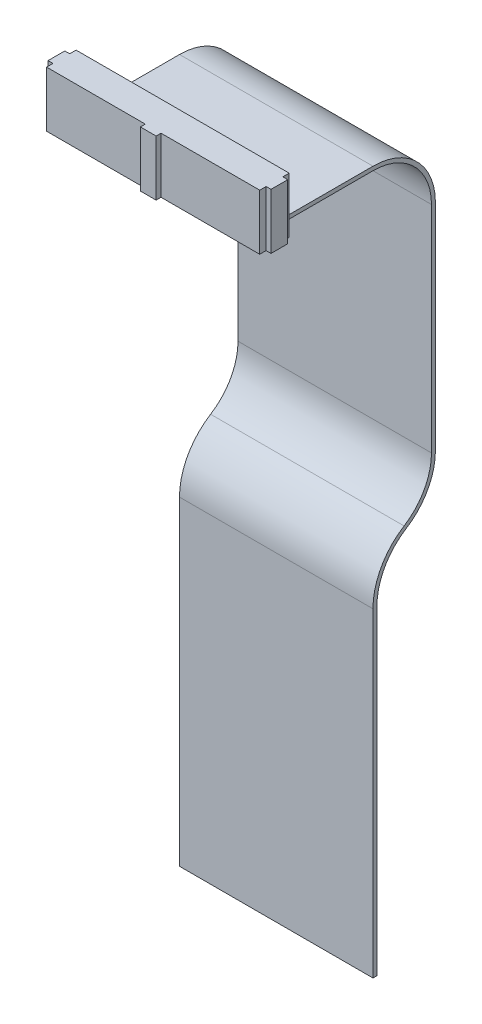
from build123d import *

# Parameters (mm, degrees)
EXTRUDE1_DEPTH = 11.3
SKETCH2_W      = 3
SKETCH2_H      = 0.8
EXTRUDE2_DEPTH = 19.685
SKETCH5_W      = 39.37
SKETCH5_H      = 0.8


with BuildPart() as part:
    # Sketch1 → Extrude1 (new body)
    with BuildSketch(Plane(origin=(0, 0, 0), x_dir=(1, 0, 0), z_dir=(0, 1, 0))):
        Polygon((-21.685, 6), (21.685, 6), (21.685, 4.7), (22.685, 4.7), (22.685, 1.3), (21.685, 1.3), (21.685, 0), (1.6, 0), (1.6, -1), (-1.6, -1), (-1.6, 0), (-21.685, 0), (-21.685, 1.3), (-22.685, 1.3), (-22.685, 4.7), (-21.685, 4.7), align=None)
    extrude(amount=EXTRUDE1_DEPTH)

    # Sketch2 → Extrude2 (add, symmetric)
    with BuildSketch(Plane(origin=(0, 0, 0), x_dir=(0, 0, -1), z_dir=(1, 0, 0))):
        with Locations((7.5, 1.6)):
            Rectangle(SKETCH2_W, SKETCH2_H)
    extrude(amount=EXTRUDE2_DEPTH, both=True)

    # Sweep2: sweep along a path in Sketch6
    with BuildLine(Plane(origin=(0, 0, 0), x_dir=(0, 0, -1), z_dir=(1, 0, 0))) as sweep2_path:
        Line((9, 2), (25.05, 2))
        ThreePointArc((25.05, 2), (34.030256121, -1.719743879), (37.75, -10.7))
        Line((37.75, -10.7), (37.75, -54.480736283))
        ThreePointArc((37.75, -54.480736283), (36.1625, -60.629097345), (31.796875, -65.240368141))
        ThreePointArc((31.796875, -65.240368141), (27.43125, -69.851638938), (25.84375, -76))
        Line((25.84375, -76), (25.84375, -141.065540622))
    # Sketch5 → Sweep2 (sweep)
    with BuildSketch(Plane(origin=(0, 0, -9), x_dir=(-1, 0, 0), z_dir=(0, 0, -1))):
        with Locations((0, 1.6)):
            Rectangle(SKETCH5_W, SKETCH5_H)
    sweep(path=sweep2_path.line)


solid = part.part
